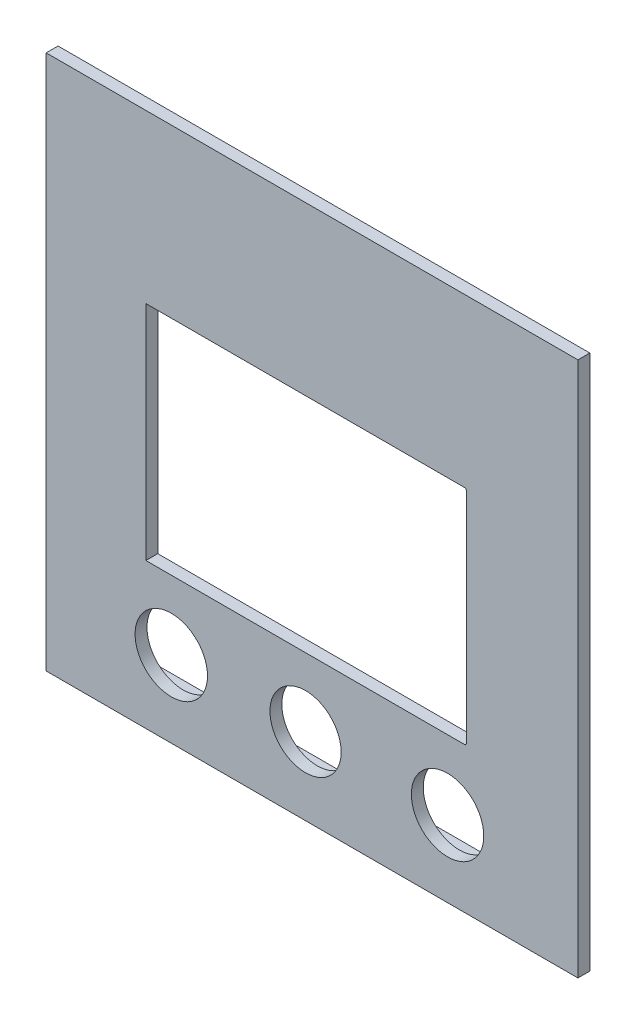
ISO-10303-21;
HEADER;
FILE_DESCRIPTION(('STEP AP214'),'2;1');
FILE_NAME('part.step','',(''),(''),'','','');
FILE_SCHEMA(('AUTOMOTIVE_DESIGN { 1 0 10303 214 1 1 1 1 }'));
ENDSEC;
DATA;
#1=APPLICATION_CONTEXT('core data for automotive mechanical design processes');
#2=APPLICATION_PROTOCOL_DEFINITION('international standard','automotive_design',2000,#1);
#3=PRODUCT_CONTEXT('',#1,'mechanical');
#4=PRODUCT('Part','Part','',(#3));
#5=PRODUCT_RELATED_PRODUCT_CATEGORY('part','',(#4));
#6=PRODUCT_DEFINITION_FORMATION('','',#4);
#7=PRODUCT_DEFINITION_CONTEXT('part definition',#1,'design');
#8=PRODUCT_DEFINITION('design','',#6,#7);
#9=PRODUCT_DEFINITION_SHAPE('','',#8);
#10=(LENGTH_UNIT() NAMED_UNIT(*) SI_UNIT(.MILLI.,.METRE.));
#11=(NAMED_UNIT(*) PLANE_ANGLE_UNIT() SI_UNIT($,.RADIAN.));
#12=(NAMED_UNIT(*) SI_UNIT($,.STERADIAN.) SOLID_ANGLE_UNIT());
#13=UNCERTAINTY_MEASURE_WITH_UNIT(LENGTH_MEASURE(1.E-05),#10,'distance_accuracy_value','');
#14=(GEOMETRIC_REPRESENTATION_CONTEXT(3) GLOBAL_UNCERTAINTY_ASSIGNED_CONTEXT((#13)) GLOBAL_UNIT_ASSIGNED_CONTEXT((#10,
#11,#12)) REPRESENTATION_CONTEXT('',''));
#15=CARTESIAN_POINT('',(0.,0.,0.));
#16=DIRECTION('',(0.,0.,1.));
#17=DIRECTION('',(1.,0.,0.));
#18=AXIS2_PLACEMENT_3D('',#15,#16,#17);
#19=CARTESIAN_POINT('',(-42.1750000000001,0.,2.));
#20=DIRECTION('',(-1.,0.,0.));
#21=DIRECTION('',(0.,-1.,0.));
#22=AXIS2_PLACEMENT_3D('',#19,#20,#21);
#23=PLANE('',#22);
#24=DIRECTION('',(0.,1.,0.));
#25=VECTOR('',#24,1.);
#26=CARTESIAN_POINT('',(-42.1750000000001,0.,0.));
#27=LINE('',#26,#25);
#28=CARTESIAN_POINT('',(-42.175,-79.624211,0.));
#29=VERTEX_POINT('',#28);
#30=CARTESIAN_POINT('',(-42.175,-42.724211,0.));
#31=VERTEX_POINT('',#30);
#32=EDGE_CURVE('E204',#29,#31,#27,.T.);
#33=ORIENTED_EDGE('',*,*,#32,.F.);
#34=DIRECTION('',(0.,0.,-1.));
#35=VECTOR('',#34,1.);
#36=CARTESIAN_POINT('',(-42.175,-79.624211,2.));
#37=LINE('',#36,#35);
#38=CARTESIAN_POINT('',(-42.175,-79.624211,2.));
#39=VERTEX_POINT('',#38);
#40=EDGE_CURVE('E216',#29,#39,#37,.F.);
#41=ORIENTED_EDGE('',*,*,#40,.T.);
#42=DIRECTION('',(0.,1.,0.));
#43=VECTOR('',#42,1.);
#44=CARTESIAN_POINT('',(-42.1750000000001,0.,2.));
#45=LINE('',#44,#43);
#46=CARTESIAN_POINT('',(-42.175,-42.724211,2.));
#47=VERTEX_POINT('',#46);
#48=EDGE_CURVE('E323',#39,#47,#45,.T.);
#49=ORIENTED_EDGE('',*,*,#48,.T.);
#50=DIRECTION('',(0.,0.,-1.));
#51=VECTOR('',#50,1.);
#52=CARTESIAN_POINT('',(-42.175,-42.724211,0.));
#53=LINE('',#52,#51);
#54=EDGE_CURVE('E212',#47,#31,#53,.T.);
#55=ORIENTED_EDGE('',*,*,#54,.T.);
#56=EDGE_LOOP('',(#33,#41,#49,#55));
#57=FACE_BOUND('',#56,.T.);
#58=ADVANCED_FACE('F45',(#57),#23,.T.);
#59=CARTESIAN_POINT('',(0.,-79.9242109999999,2.));
#60=DIRECTION('',(0.,1.,0.));
#61=DIRECTION('',(-1.,0.,0.));
#62=AXIS2_PLACEMENT_3D('',#59,#60,#61);
#63=PLANE('',#62);
#64=DIRECTION('',(0.,0.,-1.));
#65=VECTOR('',#64,1.);
#66=CARTESIAN_POINT('',(-96.175,-79.924211,2.));
#67=LINE('',#66,#65);
#68=CARTESIAN_POINT('',(-96.175,-79.924211,2.));
#69=VERTEX_POINT('',#68);
#70=CARTESIAN_POINT('',(-96.175,-79.924211,0.));
#71=VERTEX_POINT('',#70);
#72=EDGE_CURVE('E179',#69,#71,#67,.T.);
#73=ORIENTED_EDGE('',*,*,#72,.F.);
#74=DIRECTION('',(1.,0.,0.));
#75=VECTOR('',#74,1.);
#76=CARTESIAN_POINT('',(0.,-79.9242109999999,2.));
#77=LINE('',#76,#75);
#78=CARTESIAN_POINT('',(-42.475,-79.924211,2.));
#79=VERTEX_POINT('',#78);
#80=EDGE_CURVE('E327',#69,#79,#77,.T.);
#81=ORIENTED_EDGE('',*,*,#80,.T.);
#82=DIRECTION('',(0.,0.,-1.));
#83=VECTOR('',#82,1.);
#84=CARTESIAN_POINT('',(-42.475,-79.924211,0.));
#85=LINE('',#84,#83);
#86=CARTESIAN_POINT('',(-42.475,-79.924211,0.));
#87=VERTEX_POINT('',#86);
#88=EDGE_CURVE('E208',#79,#87,#85,.T.);
#89=ORIENTED_EDGE('',*,*,#88,.T.);
#90=DIRECTION('',(1.,0.,0.));
#91=VECTOR('',#90,1.);
#92=CARTESIAN_POINT('',(0.,-79.9242109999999,0.));
#93=LINE('',#92,#91);
#94=EDGE_CURVE('E197',#71,#87,#93,.T.);
#95=ORIENTED_EDGE('',*,*,#94,.F.);
#96=EDGE_LOOP('',(#73,#81,#89,#95));
#97=FACE_BOUND('',#96,.T.);
#98=ADVANCED_FACE('F365',(#97),#63,.T.);
#99=CARTESIAN_POINT('',(0.,-42.4242109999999,2.));
#100=DIRECTION('',(0.,-1.,0.));
#101=DIRECTION('',(1.,0.,0.));
#102=AXIS2_PLACEMENT_3D('',#99,#100,#101);
#103=PLANE('',#102);
#104=DIRECTION('',(0.,0.,1.));
#105=VECTOR('',#104,1.);
#106=CARTESIAN_POINT('',(-96.175,-42.424211,0.));
#107=LINE('',#106,#105);
#108=CARTESIAN_POINT('',(-96.175,-42.424211,0.));
#109=VERTEX_POINT('',#108);
#110=CARTESIAN_POINT('',(-96.175,-42.424211,2.));
#111=VERTEX_POINT('',#110);
#112=EDGE_CURVE('E177',#109,#111,#107,.T.);
#113=ORIENTED_EDGE('',*,*,#112,.F.);
#114=DIRECTION('',(-1.,0.,0.));
#115=VECTOR('',#114,1.);
#116=CARTESIAN_POINT('',(0.,-42.4242109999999,0.));
#117=LINE('',#116,#115);
#118=CARTESIAN_POINT('',(-42.475,-42.424211,0.));
#119=VERTEX_POINT('',#118);
#120=EDGE_CURVE('E187',#119,#109,#117,.T.);
#121=ORIENTED_EDGE('',*,*,#120,.F.);
#122=DIRECTION('',(0.,0.,-1.));
#123=VECTOR('',#122,1.);
#124=CARTESIAN_POINT('',(-42.475,-42.424211,2.));
#125=LINE('',#124,#123);
#126=CARTESIAN_POINT('',(-42.475,-42.424211,2.));
#127=VERTEX_POINT('',#126);
#128=EDGE_CURVE('E69',#119,#127,#125,.F.);
#129=ORIENTED_EDGE('',*,*,#128,.T.);
#130=DIRECTION('',(-1.,0.,0.));
#131=VECTOR('',#130,1.);
#132=CARTESIAN_POINT('',(0.,-42.4242109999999,2.));
#133=LINE('',#132,#131);
#134=EDGE_CURVE('E188',#127,#111,#133,.T.);
#135=ORIENTED_EDGE('',*,*,#134,.T.);
#136=EDGE_LOOP('',(#113,#121,#129,#135));
#137=FACE_BOUND('',#136,.T.);
#138=ADVANCED_FACE('F186',(#137),#103,.T.);
#139=CARTESIAN_POINT('',(-91.8933045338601,-91.5775033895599,2.));
#140=DIRECTION('',(0.,0.,-1.));
#141=DIRECTION('',(-1.,0.,0.));
#142=AXIS2_PLACEMENT_3D('',#139,#140,#141);
#143=CYLINDRICAL_SURFACE('',#142,6.09999999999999);
#144=CARTESIAN_POINT('',(-91.8933045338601,-91.5775033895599,2.));
#145=DIRECTION('',(0.,0.,1.));
#146=DIRECTION('',(1.,0.,0.));
#147=AXIS2_PLACEMENT_3D('',#144,#145,#146);
#148=CIRCLE('',#147,6.09999999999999);
#149=CARTESIAN_POINT('',(-85.7933045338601,-91.5775033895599,2.));
#150=VERTEX_POINT('',#149);
#151=EDGE_CURVE('E202',#150,#150,#148,.T.);
#152=ORIENTED_EDGE('',*,*,#151,.T.);
#153=EDGE_LOOP('',(#152));
#154=FACE_BOUND('',#153,.T.);
#155=CARTESIAN_POINT('',(-91.8933045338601,-91.5775033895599,0.));
#156=DIRECTION('',(0.,0.,1.));
#157=DIRECTION('',(1.,0.,0.));
#158=AXIS2_PLACEMENT_3D('',#155,#156,#157);
#159=CIRCLE('',#158,6.09999999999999);
#160=CARTESIAN_POINT('',(-85.7933045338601,-91.5775033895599,0.));
#161=VERTEX_POINT('',#160);
#162=EDGE_CURVE('E335',#161,#161,#159,.T.);
#163=ORIENTED_EDGE('',*,*,#162,.F.);
#164=EDGE_LOOP('',(#163));
#165=FACE_BOUND('',#164,.T.);
#166=ADVANCED_FACE('F375',(#154,#165),#143,.F.);
#167=CARTESIAN_POINT('',(-45.3451344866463,-91.6534854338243,2.));
#168=DIRECTION('',(0.,0.,-1.));
#169=DIRECTION('',(-1.,0.,0.));
#170=AXIS2_PLACEMENT_3D('',#167,#168,#169);
#171=CYLINDRICAL_SURFACE('',#170,6.1);
#172=CARTESIAN_POINT('',(-45.3451344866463,-91.6534854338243,2.));
#173=DIRECTION('',(0.,0.,1.));
#174=DIRECTION('',(1.,0.,0.));
#175=AXIS2_PLACEMENT_3D('',#172,#173,#174);
#176=CIRCLE('',#175,6.1);
#177=CARTESIAN_POINT('',(-39.2451344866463,-91.6534854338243,2.));
#178=VERTEX_POINT('',#177);
#179=EDGE_CURVE('E196',#178,#178,#176,.T.);
#180=ORIENTED_EDGE('',*,*,#179,.T.);
#181=EDGE_LOOP('',(#180));
#182=FACE_BOUND('',#181,.T.);
#183=CARTESIAN_POINT('',(-45.3451344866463,-91.6534854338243,0.));
#184=DIRECTION('',(0.,0.,1.));
#185=DIRECTION('',(1.,0.,0.));
#186=AXIS2_PLACEMENT_3D('',#183,#184,#185);
#187=CIRCLE('',#186,6.1);
#188=CARTESIAN_POINT('',(-39.2451344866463,-91.6534854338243,0.));
#189=VERTEX_POINT('',#188);
#190=EDGE_CURVE('E318',#189,#189,#187,.T.);
#191=ORIENTED_EDGE('',*,*,#190,.F.);
#192=EDGE_LOOP('',(#191));
#193=FACE_BOUND('',#192,.T.);
#194=ADVANCED_FACE('F378',(#182,#193),#171,.F.);
#195=CARTESIAN_POINT('',(0.,0.,2.));
#196=DIRECTION('',(0.,0.,1.));
#197=DIRECTION('',(1.,0.,0.));
#198=AXIS2_PLACEMENT_3D('',#195,#196,#197);
#199=PLANE('',#198);
#200=ORIENTED_EDGE('',*,*,#80,.F.);
#201=DIRECTION('',(0.,1.,0.));
#202=VECTOR('',#201,1.);
#203=CARTESIAN_POINT('',(-96.175,-42.424211,2.));
#204=LINE('',#203,#202);
#205=EDGE_CURVE('E184',#69,#111,#204,.T.);
#206=ORIENTED_EDGE('',*,*,#205,.T.);
#207=ORIENTED_EDGE('',*,*,#134,.F.);
#208=CARTESIAN_POINT('',(-42.475,-42.724211,2.));
#209=DIRECTION('',(0.,0.,1.));
#210=DIRECTION('',(1.,0.,0.));
#211=AXIS2_PLACEMENT_3D('',#208,#209,#210);
#212=CIRCLE('',#211,0.3);
#213=EDGE_CURVE('E230',#127,#47,#212,.F.);
#214=ORIENTED_EDGE('',*,*,#213,.T.);
#215=ORIENTED_EDGE('',*,*,#48,.F.);
#216=CARTESIAN_POINT('',(-42.475,-79.624211,2.));
#217=DIRECTION('',(0.,0.,1.));
#218=DIRECTION('',(1.,0.,0.));
#219=AXIS2_PLACEMENT_3D('',#216,#217,#218);
#220=CIRCLE('',#219,0.3);
#221=EDGE_CURVE('E224',#39,#79,#220,.F.);
#222=ORIENTED_EDGE('',*,*,#221,.T.);
#223=EDGE_LOOP('',(#200,#206,#207,#214,#215,#222));
#224=FACE_BOUND('',#223,.T.);
#225=CARTESIAN_POINT('',(-69.275,-91.444211,2.));
#226=DIRECTION('',(0.,0.,1.));
#227=DIRECTION('',(1.,0.,0.));
#228=AXIS2_PLACEMENT_3D('',#225,#226,#227);
#229=CIRCLE('',#228,6.);
#230=CARTESIAN_POINT('',(-63.275,-91.444211,2.));
#231=VERTEX_POINT('',#230);
#232=EDGE_CURVE('E671',#231,#231,#229,.T.);
#233=ORIENTED_EDGE('',*,*,#232,.F.);
#234=EDGE_LOOP('',(#233));
#235=FACE_BOUND('',#234,.T.);
#236=ORIENTED_EDGE('',*,*,#179,.F.);
#237=EDGE_LOOP('',(#236));
#238=FACE_BOUND('',#237,.T.);
#239=ORIENTED_EDGE('',*,*,#151,.F.);
#240=EDGE_LOOP('',(#239));
#241=FACE_BOUND('',#240,.T.);
#242=DIRECTION('',(-1.,0.,0.));
#243=VECTOR('',#242,1.);
#244=CARTESIAN_POINT('',(-112.975,-14.244211,2.));
#245=LINE('',#244,#243);
#246=CARTESIAN_POINT('',(-23.375,-14.244211,2.));
#247=VERTEX_POINT('',#246);
#248=CARTESIAN_POINT('',(-112.975,-14.244211,2.));
#249=VERTEX_POINT('',#248);
#250=EDGE_CURVE('E708',#247,#249,#245,.T.);
#251=ORIENTED_EDGE('',*,*,#250,.T.);
#252=DIRECTION('',(0.,-1.,0.));
#253=VECTOR('',#252,1.);
#254=CARTESIAN_POINT('',(-112.975,-14.244211,2.));
#255=LINE('',#254,#253);
#256=CARTESIAN_POINT('',(-112.975,-104.444211,2.));
#257=VERTEX_POINT('',#256);
#258=EDGE_CURVE('E704',#249,#257,#255,.T.);
#259=ORIENTED_EDGE('',*,*,#258,.T.);
#260=DIRECTION('',(1.,0.,0.));
#261=VECTOR('',#260,1.);
#262=CARTESIAN_POINT('',(-112.975,-104.444211,2.));
#263=LINE('',#262,#261);
#264=CARTESIAN_POINT('',(-23.375,-104.444211,2.));
#265=VERTEX_POINT('',#264);
#266=EDGE_CURVE('E700',#257,#265,#263,.T.);
#267=ORIENTED_EDGE('',*,*,#266,.T.);
#268=DIRECTION('',(0.,1.,0.));
#269=VECTOR('',#268,1.);
#270=CARTESIAN_POINT('',(-23.375,-14.244211,2.));
#271=LINE('',#270,#269);
#272=EDGE_CURVE('E695',#265,#247,#271,.T.);
#273=ORIENTED_EDGE('',*,*,#272,.T.);
#274=EDGE_LOOP('',(#251,#259,#267,#273));
#275=FACE_BOUND('',#274,.T.);
#276=ADVANCED_FACE('F351',(#224,#235,#238,#241,#275),#199,.T.);
#277=CARTESIAN_POINT('',(0.,0.,0.));
#278=DIRECTION('',(0.,0.,1.));
#279=DIRECTION('',(1.,0.,0.));
#280=AXIS2_PLACEMENT_3D('',#277,#278,#279);
#281=PLANE('',#280);
#282=DIRECTION('',(0.,1.,0.));
#283=VECTOR('',#282,1.);
#284=CARTESIAN_POINT('',(-96.175,-42.424211,0.));
#285=LINE('',#284,#283);
#286=EDGE_CURVE('E174',#71,#109,#285,.T.);
#287=ORIENTED_EDGE('',*,*,#286,.F.);
#288=ORIENTED_EDGE('',*,*,#94,.T.);
#289=CARTESIAN_POINT('',(-42.475,-79.624211,0.));
#290=DIRECTION('',(0.,0.,1.));
#291=DIRECTION('',(1.,0.,0.));
#292=AXIS2_PLACEMENT_3D('',#289,#290,#291);
#293=CIRCLE('',#292,0.3);
#294=EDGE_CURVE('E221',#87,#29,#293,.T.);
#295=ORIENTED_EDGE('',*,*,#294,.T.);
#296=ORIENTED_EDGE('',*,*,#32,.T.);
#297=CARTESIAN_POINT('',(-42.475,-42.724211,0.));
#298=DIRECTION('',(0.,0.,1.));
#299=DIRECTION('',(1.,0.,0.));
#300=AXIS2_PLACEMENT_3D('',#297,#298,#299);
#301=CIRCLE('',#300,0.3);
#302=EDGE_CURVE('E194',#31,#119,#301,.T.);
#303=ORIENTED_EDGE('',*,*,#302,.T.);
#304=ORIENTED_EDGE('',*,*,#120,.T.);
#305=EDGE_LOOP('',(#287,#288,#295,#296,#303,#304));
#306=FACE_BOUND('',#305,.T.);
#307=CARTESIAN_POINT('',(-69.275,-91.444211,0.));
#308=DIRECTION('',(0.,0.,1.));
#309=DIRECTION('',(1.,0.,0.));
#310=AXIS2_PLACEMENT_3D('',#307,#308,#309);
#311=CIRCLE('',#310,6.);
#312=CARTESIAN_POINT('',(-63.275,-91.444211,0.));
#313=VERTEX_POINT('',#312);
#314=EDGE_CURVE('E11',#313,#313,#311,.T.);
#315=ORIENTED_EDGE('',*,*,#314,.T.);
#316=EDGE_LOOP('',(#315));
#317=FACE_BOUND('',#316,.T.);
#318=DIRECTION('',(0.,-1.,0.));
#319=VECTOR('',#318,1.);
#320=CARTESIAN_POINT('',(-28.575,-19.444211,0.));
#321=LINE('',#320,#319);
#322=CARTESIAN_POINT('',(-28.575,-19.444211,0.));
#323=VERTEX_POINT('',#322);
#324=CARTESIAN_POINT('',(-28.575,-99.244211,0.));
#325=VERTEX_POINT('',#324);
#326=EDGE_CURVE('E240',#323,#325,#321,.T.);
#327=ORIENTED_EDGE('',*,*,#326,.T.);
#328=DIRECTION('',(-1.,0.,0.));
#329=VECTOR('',#328,1.);
#330=CARTESIAN_POINT('',(0.,-99.244211,0.));
#331=LINE('',#330,#329);
#332=CARTESIAN_POINT('',(-107.775,-99.244211,0.));
#333=VERTEX_POINT('',#332);
#334=EDGE_CURVE('E54',#325,#333,#331,.T.);
#335=ORIENTED_EDGE('',*,*,#334,.T.);
#336=DIRECTION('',(0.,1.,0.));
#337=VECTOR('',#336,1.);
#338=CARTESIAN_POINT('',(-107.775,-19.444211,0.));
#339=LINE('',#338,#337);
#340=CARTESIAN_POINT('',(-107.775,-19.444211,0.));
#341=VERTEX_POINT('',#340);
#342=EDGE_CURVE('E239',#333,#341,#339,.T.);
#343=ORIENTED_EDGE('',*,*,#342,.T.);
#344=DIRECTION('',(1.,0.,0.));
#345=VECTOR('',#344,1.);
#346=CARTESIAN_POINT('',(-28.575,-19.444211,0.));
#347=LINE('',#346,#345);
#348=EDGE_CURVE('E261',#341,#323,#347,.T.);
#349=ORIENTED_EDGE('',*,*,#348,.T.);
#350=EDGE_LOOP('',(#327,#335,#343,#349));
#351=FACE_BOUND('',#350,.T.);
#352=ORIENTED_EDGE('',*,*,#190,.T.);
#353=EDGE_LOOP('',(#352));
#354=FACE_BOUND('',#353,.T.);
#355=ORIENTED_EDGE('',*,*,#162,.T.);
#356=EDGE_LOOP('',(#355));
#357=FACE_BOUND('',#356,.T.);
#358=ADVANCED_FACE('F191',(#306,#317,#351,#354,#357),#281,.F.);
#359=CARTESIAN_POINT('',(-42.475,-79.624211,2.));
#360=DIRECTION('',(0.,0.,1.));
#361=DIRECTION('',(1.,0.,0.));
#362=AXIS2_PLACEMENT_3D('',#359,#360,#361);
#363=CYLINDRICAL_SURFACE('',#362,0.3);
#364=ORIENTED_EDGE('',*,*,#221,.F.);
#365=ORIENTED_EDGE('',*,*,#40,.F.);
#366=ORIENTED_EDGE('',*,*,#294,.F.);
#367=ORIENTED_EDGE('',*,*,#88,.F.);
#368=EDGE_LOOP('',(#364,#365,#366,#367));
#369=FACE_BOUND('',#368,.T.);
#370=ADVANCED_FACE('F347',(#369),#363,.F.);
#371=CARTESIAN_POINT('',(-42.475,-42.724211,2.));
#372=DIRECTION('',(0.,0.,1.));
#373=DIRECTION('',(1.,0.,0.));
#374=AXIS2_PLACEMENT_3D('',#371,#372,#373);
#375=CYLINDRICAL_SURFACE('',#374,0.3);
#376=ORIENTED_EDGE('',*,*,#213,.F.);
#377=ORIENTED_EDGE('',*,*,#128,.F.);
#378=ORIENTED_EDGE('',*,*,#302,.F.);
#379=ORIENTED_EDGE('',*,*,#54,.F.);
#380=EDGE_LOOP('',(#376,#377,#378,#379));
#381=FACE_BOUND('',#380,.T.);
#382=ADVANCED_FACE('F47',(#381),#375,.F.);
#383=CARTESIAN_POINT('',(0.,0.,-3.));
#384=DIRECTION('',(0.,0.,-1.));
#385=DIRECTION('',(-1.,0.,0.));
#386=AXIS2_PLACEMENT_3D('',#383,#384,#385);
#387=PLANE('',#386);
#388=DIRECTION('',(1.,0.,0.));
#389=VECTOR('',#388,1.);
#390=CARTESIAN_POINT('',(-109.175,-18.044211,-3.));
#391=LINE('',#390,#389);
#392=CARTESIAN_POINT('',(-109.175,-18.044211,-3.));
#393=VERTEX_POINT('',#392);
#394=CARTESIAN_POINT('',(-27.175,-18.044211,-3.));
#395=VERTEX_POINT('',#394);
#396=EDGE_CURVE('E275',#393,#395,#391,.T.);
#397=ORIENTED_EDGE('',*,*,#396,.T.);
#398=DIRECTION('',(0.,-1.,0.));
#399=VECTOR('',#398,1.);
#400=CARTESIAN_POINT('',(-27.175,-18.044211,-3.));
#401=LINE('',#400,#399);
#402=CARTESIAN_POINT('',(-27.175,-100.644211,-3.));
#403=VERTEX_POINT('',#402);
#404=EDGE_CURVE('E279',#395,#403,#401,.T.);
#405=ORIENTED_EDGE('',*,*,#404,.T.);
#406=DIRECTION('',(-1.,0.,0.));
#407=VECTOR('',#406,1.);
#408=CARTESIAN_POINT('',(-27.175,-100.644211,-3.));
#409=LINE('',#408,#407);
#410=CARTESIAN_POINT('',(-109.175,-100.644211,-3.));
#411=VERTEX_POINT('',#410);
#412=EDGE_CURVE('E283',#403,#411,#409,.T.);
#413=ORIENTED_EDGE('',*,*,#412,.T.);
#414=DIRECTION('',(0.,1.,0.));
#415=VECTOR('',#414,1.);
#416=CARTESIAN_POINT('',(-109.175,-100.644211,-3.));
#417=LINE('',#416,#415);
#418=EDGE_CURVE('E286',#411,#393,#417,.T.);
#419=ORIENTED_EDGE('',*,*,#418,.T.);
#420=EDGE_LOOP('',(#397,#405,#413,#419));
#421=FACE_BOUND('',#420,.T.);
#422=DIRECTION('',(0.,-1.,0.));
#423=VECTOR('',#422,1.);
#424=CARTESIAN_POINT('',(-28.575,-19.444211,-3.));
#425=LINE('',#424,#423);
#426=CARTESIAN_POINT('',(-28.575,-19.444211,-3.));
#427=VERTEX_POINT('',#426);
#428=CARTESIAN_POINT('',(-28.575,-99.244211,-3.));
#429=VERTEX_POINT('',#428);
#430=EDGE_CURVE('E259',#427,#429,#425,.T.);
#431=ORIENTED_EDGE('',*,*,#430,.F.);
#432=DIRECTION('',(1.,0.,0.));
#433=VECTOR('',#432,1.);
#434=CARTESIAN_POINT('',(-28.575,-19.444211,-3.));
#435=LINE('',#434,#433);
#436=CARTESIAN_POINT('',(-107.775,-19.444211,-3.));
#437=VERTEX_POINT('',#436);
#438=EDGE_CURVE('E255',#437,#427,#435,.T.);
#439=ORIENTED_EDGE('',*,*,#438,.F.);
#440=DIRECTION('',(0.,1.,0.));
#441=VECTOR('',#440,1.);
#442=CARTESIAN_POINT('',(-107.775,-19.444211,-3.));
#443=LINE('',#442,#441);
#444=CARTESIAN_POINT('',(-107.775,-99.244211,-3.));
#445=VERTEX_POINT('',#444);
#446=EDGE_CURVE('E266',#445,#437,#443,.T.);
#447=ORIENTED_EDGE('',*,*,#446,.F.);
#448=DIRECTION('',(-1.,0.,0.));
#449=VECTOR('',#448,1.);
#450=CARTESIAN_POINT('',(-28.575,-99.244211,-3.));
#451=LINE('',#450,#449);
#452=EDGE_CURVE('E248',#429,#445,#451,.T.);
#453=ORIENTED_EDGE('',*,*,#452,.F.);
#454=EDGE_LOOP('',(#431,#439,#447,#453));
#455=FACE_BOUND('',#454,.T.);
#456=ADVANCED_FACE('F356',(#421,#455),#387,.T.);
#457=CARTESIAN_POINT('',(-109.175,-18.044211,-3.));
#458=DIRECTION('',(0.,-1.,0.));
#459=DIRECTION('',(0.,0.,-1.));
#460=AXIS2_PLACEMENT_3D('',#457,#458,#459);
#461=PLANE('',#460);
#462=DIRECTION('',(1.,0.,0.));
#463=VECTOR('',#462,1.);
#464=CARTESIAN_POINT('',(-109.175,-18.044211,0.));
#465=LINE('',#464,#463);
#466=CARTESIAN_POINT('',(-109.175,-18.044211,0.));
#467=VERTEX_POINT('',#466);
#468=CARTESIAN_POINT('',(-27.175,-18.044211,0.));
#469=VERTEX_POINT('',#468);
#470=EDGE_CURVE('E274',#467,#469,#465,.T.);
#471=ORIENTED_EDGE('',*,*,#470,.T.);
#472=DIRECTION('',(0.,0.,1.));
#473=VECTOR('',#472,1.);
#474=CARTESIAN_POINT('',(-27.175,-18.044211,-3.));
#475=LINE('',#474,#473);
#476=EDGE_CURVE('E315',#395,#469,#475,.T.);
#477=ORIENTED_EDGE('',*,*,#476,.F.);
#478=ORIENTED_EDGE('',*,*,#396,.F.);
#479=DIRECTION('',(0.,0.,1.));
#480=VECTOR('',#479,1.);
#481=CARTESIAN_POINT('',(-109.175,-18.044211,-3.));
#482=LINE('',#481,#480);
#483=EDGE_CURVE('E289',#393,#467,#482,.T.);
#484=ORIENTED_EDGE('',*,*,#483,.T.);
#485=EDGE_LOOP('',(#471,#477,#478,#484));
#486=FACE_BOUND('',#485,.T.);
#487=ADVANCED_FACE('F361',(#486),#461,.F.);
#488=CARTESIAN_POINT('',(-27.175,-18.044211,-3.));
#489=DIRECTION('',(-1.,0.,0.));
#490=DIRECTION('',(0.,0.,1.));
#491=AXIS2_PLACEMENT_3D('',#488,#489,#490);
#492=PLANE('',#491);
#493=DIRECTION('',(0.,-1.,0.));
#494=VECTOR('',#493,1.);
#495=CARTESIAN_POINT('',(-27.175,-18.044211,0.));
#496=LINE('',#495,#494);
#497=CARTESIAN_POINT('',(-27.175,-100.644211,0.));
#498=VERTEX_POINT('',#497);
#499=EDGE_CURVE('E293',#469,#498,#496,.T.);
#500=ORIENTED_EDGE('',*,*,#499,.T.);
#501=DIRECTION('',(0.,0.,1.));
#502=VECTOR('',#501,1.);
#503=CARTESIAN_POINT('',(-27.175,-100.644211,-3.));
#504=LINE('',#503,#502);
#505=EDGE_CURVE('E311',#403,#498,#504,.T.);
#506=ORIENTED_EDGE('',*,*,#505,.F.);
#507=ORIENTED_EDGE('',*,*,#404,.F.);
#508=ORIENTED_EDGE('',*,*,#476,.T.);
#509=EDGE_LOOP('',(#500,#506,#507,#508));
#510=FACE_BOUND('',#509,.T.);
#511=ADVANCED_FACE('F484',(#510),#492,.F.);
#512=CARTESIAN_POINT('',(-27.175,-100.644211,-3.));
#513=DIRECTION('',(0.,1.,0.));
#514=DIRECTION('',(0.,0.,1.));
#515=AXIS2_PLACEMENT_3D('',#512,#513,#514);
#516=PLANE('',#515);
#517=DIRECTION('',(-1.,0.,0.));
#518=VECTOR('',#517,1.);
#519=CARTESIAN_POINT('',(-27.175,-100.644211,0.));
#520=LINE('',#519,#518);
#521=CARTESIAN_POINT('',(-109.175,-100.644211,0.));
#522=VERTEX_POINT('',#521);
#523=EDGE_CURVE('E297',#498,#522,#520,.T.);
#524=ORIENTED_EDGE('',*,*,#523,.T.);
#525=DIRECTION('',(0.,0.,1.));
#526=VECTOR('',#525,1.);
#527=CARTESIAN_POINT('',(-109.175,-100.644211,-3.));
#528=LINE('',#527,#526);
#529=EDGE_CURVE('E307',#411,#522,#528,.T.);
#530=ORIENTED_EDGE('',*,*,#529,.F.);
#531=ORIENTED_EDGE('',*,*,#412,.F.);
#532=ORIENTED_EDGE('',*,*,#505,.T.);
#533=EDGE_LOOP('',(#524,#530,#531,#532));
#534=FACE_BOUND('',#533,.T.);
#535=ADVANCED_FACE('F475',(#534),#516,.F.);
#536=CARTESIAN_POINT('',(-109.175,-100.644211,-3.));
#537=DIRECTION('',(1.,0.,0.));
#538=DIRECTION('',(0.,0.,-1.));
#539=AXIS2_PLACEMENT_3D('',#536,#537,#538);
#540=PLANE('',#539);
#541=DIRECTION('',(0.,1.,0.));
#542=VECTOR('',#541,1.);
#543=CARTESIAN_POINT('',(-109.175,-100.644211,0.));
#544=LINE('',#543,#542);
#545=EDGE_CURVE('E280',#522,#467,#544,.T.);
#546=ORIENTED_EDGE('',*,*,#545,.T.);
#547=ORIENTED_EDGE('',*,*,#483,.F.);
#548=ORIENTED_EDGE('',*,*,#418,.F.);
#549=ORIENTED_EDGE('',*,*,#529,.T.);
#550=EDGE_LOOP('',(#546,#547,#548,#549));
#551=FACE_BOUND('',#550,.T.);
#552=ADVANCED_FACE('F470',(#551),#540,.F.);
#553=CARTESIAN_POINT('',(-28.575,-19.444211,-3.));
#554=DIRECTION('',(0.,-1.,0.));
#555=DIRECTION('',(0.,0.,-1.));
#556=AXIS2_PLACEMENT_3D('',#553,#554,#555);
#557=PLANE('',#556);
#558=ORIENTED_EDGE('',*,*,#348,.F.);
#559=DIRECTION('',(0.,0.,1.));
#560=VECTOR('',#559,1.);
#561=CARTESIAN_POINT('',(-107.775,-19.444211,-3.));
#562=LINE('',#561,#560);
#563=EDGE_CURVE('E61',#437,#341,#562,.T.);
#564=ORIENTED_EDGE('',*,*,#563,.F.);
#565=ORIENTED_EDGE('',*,*,#438,.T.);
#566=DIRECTION('',(0.,0.,1.));
#567=VECTOR('',#566,1.);
#568=CARTESIAN_POINT('',(-28.575,-19.444211,-3.));
#569=LINE('',#568,#567);
#570=EDGE_CURVE('E270',#427,#323,#569,.T.);
#571=ORIENTED_EDGE('',*,*,#570,.T.);
#572=EDGE_LOOP('',(#558,#564,#565,#571));
#573=FACE_BOUND('',#572,.T.);
#574=ADVANCED_FACE('F474',(#573),#557,.T.);
#575=CARTESIAN_POINT('',(-28.575,-19.444211,-3.));
#576=DIRECTION('',(-1.,0.,0.));
#577=DIRECTION('',(0.,0.,1.));
#578=AXIS2_PLACEMENT_3D('',#575,#576,#577);
#579=PLANE('',#578);
#580=ORIENTED_EDGE('',*,*,#326,.F.);
#581=ORIENTED_EDGE('',*,*,#570,.F.);
#582=ORIENTED_EDGE('',*,*,#430,.T.);
#583=DIRECTION('',(0.,0.,1.));
#584=VECTOR('',#583,1.);
#585=CARTESIAN_POINT('',(-28.575,-99.244211,-3.));
#586=LINE('',#585,#584);
#587=EDGE_CURVE('E251',#429,#325,#586,.T.);
#588=ORIENTED_EDGE('',*,*,#587,.T.);
#589=EDGE_LOOP('',(#580,#581,#582,#588));
#590=FACE_BOUND('',#589,.T.);
#591=ADVANCED_FACE('F516',(#590),#579,.T.);
#592=CARTESIAN_POINT('',(-28.575,-99.244211,-3.));
#593=DIRECTION('',(0.,1.,0.));
#594=DIRECTION('',(0.,0.,1.));
#595=AXIS2_PLACEMENT_3D('',#592,#593,#594);
#596=PLANE('',#595);
#597=ORIENTED_EDGE('',*,*,#334,.F.);
#598=ORIENTED_EDGE('',*,*,#587,.F.);
#599=ORIENTED_EDGE('',*,*,#452,.T.);
#600=DIRECTION('',(0.,0.,1.));
#601=VECTOR('',#600,1.);
#602=CARTESIAN_POINT('',(-107.775,-99.244211,-3.));
#603=LINE('',#602,#601);
#604=EDGE_CURVE('E245',#445,#333,#603,.T.);
#605=ORIENTED_EDGE('',*,*,#604,.T.);
#606=EDGE_LOOP('',(#597,#598,#599,#605));
#607=FACE_BOUND('',#606,.T.);
#608=ADVANCED_FACE('F246',(#607),#596,.T.);
#609=CARTESIAN_POINT('',(-107.775,-19.444211,-3.));
#610=DIRECTION('',(1.,0.,0.));
#611=DIRECTION('',(0.,0.,-1.));
#612=AXIS2_PLACEMENT_3D('',#609,#610,#611);
#613=PLANE('',#612);
#614=ORIENTED_EDGE('',*,*,#342,.F.);
#615=ORIENTED_EDGE('',*,*,#604,.F.);
#616=ORIENTED_EDGE('',*,*,#446,.T.);
#617=ORIENTED_EDGE('',*,*,#563,.T.);
#618=EDGE_LOOP('',(#614,#615,#616,#617));
#619=FACE_BOUND('',#618,.T.);
#620=ADVANCED_FACE('F253',(#619),#613,.T.);
#621=CARTESIAN_POINT('',(-69.275,-91.444211,-1.));
#622=DIRECTION('',(0.,0.,1.));
#623=DIRECTION('',(1.,0.,0.));
#624=AXIS2_PLACEMENT_3D('',#621,#622,#623);
#625=CYLINDRICAL_SURFACE('',#624,6.);
#626=ORIENTED_EDGE('',*,*,#232,.T.);
#627=EDGE_LOOP('',(#626));
#628=FACE_BOUND('',#627,.T.);
#629=ORIENTED_EDGE('',*,*,#314,.F.);
#630=EDGE_LOOP('',(#629));
#631=FACE_BOUND('',#630,.T.);
#632=ADVANCED_FACE('F461',(#628,#631),#625,.F.);
#633=CARTESIAN_POINT('',(0.,0.,0.));
#634=DIRECTION('',(0.,0.,-1.));
#635=DIRECTION('',(-1.,0.,0.));
#636=AXIS2_PLACEMENT_3D('',#633,#634,#635);
#637=PLANE('',#636);
#638=DIRECTION('',(-1.,0.,0.));
#639=VECTOR('',#638,1.);
#640=CARTESIAN_POINT('',(-112.975,-14.244211,0.));
#641=LINE('',#640,#639);
#642=CARTESIAN_POINT('',(-23.375,-14.244211,0.));
#643=VERTEX_POINT('',#642);
#644=CARTESIAN_POINT('',(-112.975,-14.244211,0.));
#645=VERTEX_POINT('',#644);
#646=EDGE_CURVE('E699',#643,#645,#641,.T.);
#647=ORIENTED_EDGE('',*,*,#646,.F.);
#648=DIRECTION('',(0.,1.,0.));
#649=VECTOR('',#648,1.);
#650=CARTESIAN_POINT('',(-23.375,-14.244211,0.));
#651=LINE('',#650,#649);
#652=CARTESIAN_POINT('',(-23.375,-104.444211,0.));
#653=VERTEX_POINT('',#652);
#654=EDGE_CURVE('E687',#653,#643,#651,.T.);
#655=ORIENTED_EDGE('',*,*,#654,.F.);
#656=DIRECTION('',(1.,0.,0.));
#657=VECTOR('',#656,1.);
#658=CARTESIAN_POINT('',(-112.975,-104.444211,0.));
#659=LINE('',#658,#657);
#660=CARTESIAN_POINT('',(-112.975,-104.444211,0.));
#661=VERTEX_POINT('',#660);
#662=EDGE_CURVE('E715',#661,#653,#659,.T.);
#663=ORIENTED_EDGE('',*,*,#662,.F.);
#664=DIRECTION('',(0.,-1.,0.));
#665=VECTOR('',#664,1.);
#666=CARTESIAN_POINT('',(-112.975,-14.244211,0.));
#667=LINE('',#666,#665);
#668=EDGE_CURVE('E719',#645,#661,#667,.T.);
#669=ORIENTED_EDGE('',*,*,#668,.F.);
#670=EDGE_LOOP('',(#647,#655,#663,#669));
#671=FACE_BOUND('',#670,.T.);
#672=ORIENTED_EDGE('',*,*,#470,.F.);
#673=ORIENTED_EDGE('',*,*,#545,.F.);
#674=ORIENTED_EDGE('',*,*,#523,.F.);
#675=ORIENTED_EDGE('',*,*,#499,.F.);
#676=EDGE_LOOP('',(#672,#673,#674,#675));
#677=FACE_BOUND('',#676,.T.);
#678=ADVANCED_FACE('F454',(#671,#677),#637,.T.);
#679=CARTESIAN_POINT('',(-112.975,-14.244211,0.));
#680=DIRECTION('',(0.,1.,0.));
#681=DIRECTION('',(0.,0.,1.));
#682=AXIS2_PLACEMENT_3D('',#679,#680,#681);
#683=PLANE('',#682);
#684=ORIENTED_EDGE('',*,*,#250,.F.);
#685=DIRECTION('',(0.,0.,1.));
#686=VECTOR('',#685,1.);
#687=CARTESIAN_POINT('',(-23.375,-14.244211,0.));
#688=LINE('',#687,#686);
#689=EDGE_CURVE('E674',#643,#247,#688,.T.);
#690=ORIENTED_EDGE('',*,*,#689,.F.);
#691=ORIENTED_EDGE('',*,*,#646,.T.);
#692=DIRECTION('',(0.,0.,1.));
#693=VECTOR('',#692,1.);
#694=CARTESIAN_POINT('',(-112.975,-14.244211,0.));
#695=LINE('',#694,#693);
#696=EDGE_CURVE('E683',#645,#249,#695,.T.);
#697=ORIENTED_EDGE('',*,*,#696,.T.);
#698=EDGE_LOOP('',(#684,#690,#691,#697));
#699=FACE_BOUND('',#698,.T.);
#700=ADVANCED_FACE('F447',(#699),#683,.T.);
#701=CARTESIAN_POINT('',(-23.375,-14.244211,0.));
#702=DIRECTION('',(1.,0.,0.));
#703=DIRECTION('',(0.,1.,0.));
#704=AXIS2_PLACEMENT_3D('',#701,#702,#703);
#705=PLANE('',#704);
#706=ORIENTED_EDGE('',*,*,#272,.F.);
#707=DIRECTION('',(0.,0.,1.));
#708=VECTOR('',#707,1.);
#709=CARTESIAN_POINT('',(-23.375,-104.444211,0.));
#710=LINE('',#709,#708);
#711=EDGE_CURVE('E690',#653,#265,#710,.T.);
#712=ORIENTED_EDGE('',*,*,#711,.F.);
#713=ORIENTED_EDGE('',*,*,#654,.T.);
#714=ORIENTED_EDGE('',*,*,#689,.T.);
#715=EDGE_LOOP('',(#706,#712,#713,#714));
#716=FACE_BOUND('',#715,.T.);
#717=ADVANCED_FACE('F439',(#716),#705,.T.);
#718=CARTESIAN_POINT('',(-112.975,-104.444211,0.));
#719=DIRECTION('',(0.,-1.,0.));
#720=DIRECTION('',(0.,0.,-1.));
#721=AXIS2_PLACEMENT_3D('',#718,#719,#720);
#722=PLANE('',#721);
#723=ORIENTED_EDGE('',*,*,#266,.F.);
#724=DIRECTION('',(0.,0.,1.));
#725=VECTOR('',#724,1.);
#726=CARTESIAN_POINT('',(-112.975,-104.444211,0.));
#727=LINE('',#726,#725);
#728=EDGE_CURVE('E686',#661,#257,#727,.T.);
#729=ORIENTED_EDGE('',*,*,#728,.F.);
#730=ORIENTED_EDGE('',*,*,#662,.T.);
#731=ORIENTED_EDGE('',*,*,#711,.T.);
#732=EDGE_LOOP('',(#723,#729,#730,#731));
#733=FACE_BOUND('',#732,.T.);
#734=ADVANCED_FACE('F432',(#733),#722,.T.);
#735=CARTESIAN_POINT('',(-112.975,-14.244211,0.));
#736=DIRECTION('',(-1.,0.,0.));
#737=DIRECTION('',(0.,0.,1.));
#738=AXIS2_PLACEMENT_3D('',#735,#736,#737);
#739=PLANE('',#738);
#740=ORIENTED_EDGE('',*,*,#258,.F.);
#741=ORIENTED_EDGE('',*,*,#696,.F.);
#742=ORIENTED_EDGE('',*,*,#668,.T.);
#743=ORIENTED_EDGE('',*,*,#728,.T.);
#744=EDGE_LOOP('',(#740,#741,#742,#743));
#745=FACE_BOUND('',#744,.T.);
#746=ADVANCED_FACE('F423',(#745),#739,.T.);
#747=CARTESIAN_POINT('',(-96.175,-42.424211,0.));
#748=DIRECTION('',(1.,0.,0.));
#749=DIRECTION('',(0.,0.,-1.));
#750=AXIS2_PLACEMENT_3D('',#747,#748,#749);
#751=PLANE('',#750);
#752=ORIENTED_EDGE('',*,*,#205,.F.);
#753=ORIENTED_EDGE('',*,*,#72,.T.);
#754=ORIENTED_EDGE('',*,*,#286,.T.);
#755=ORIENTED_EDGE('',*,*,#112,.T.);
#756=EDGE_LOOP('',(#752,#753,#754,#755));
#757=FACE_BOUND('',#756,.T.);
#758=ADVANCED_FACE('F176',(#757),#751,.T.);
#759=CLOSED_SHELL('',(#58,#98,#138,#166,#194,#276,#358,#370,#382,#456,#487,#511,#535,#552,#574,
#591,#608,#620,#632,#678,#700,#717,#734,#746,#758));
#760=MANIFOLD_SOLID_BREP('B2',#759);
#761=ADVANCED_BREP_SHAPE_REPRESENTATION('',(#18,#760),#14);
#762=SHAPE_DEFINITION_REPRESENTATION(#9,#761);
ENDSEC;
END-ISO-10303-21;
